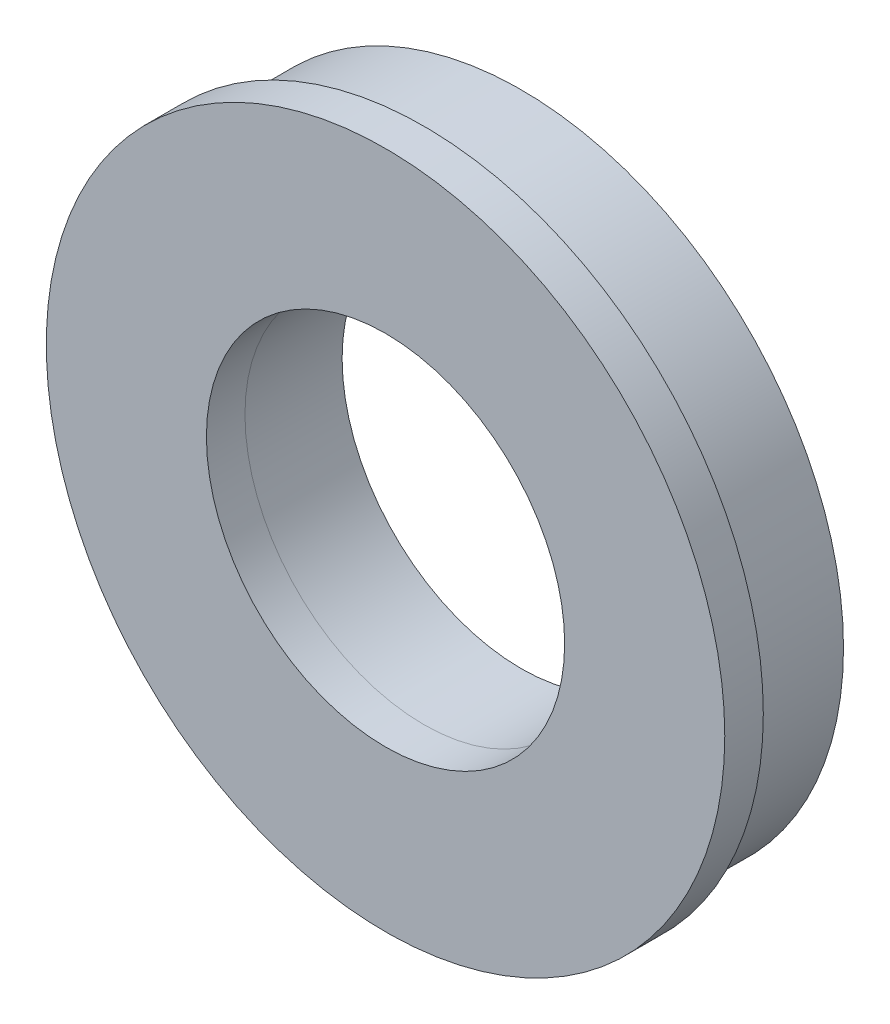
from build123d import *

# Parameters (mm, degrees)
SKETCH1_R      = 7.9375
SKETCH1_R_2    = 4.191
EXTRUDE1_DEPTH = 0.9017
SKETCH2_R      = 7.540625
SKETCH2_R_2    = 4.191
EXTRUDE2_DEPTH = 2.2733


with BuildPart() as part:
    # Sketch1 → Extrude1 (new body)
    with BuildSketch(Plane.XY):
        Circle(SKETCH1_R)
        Circle(SKETCH1_R_2, mode=Mode.SUBTRACT)
    extrude(amount=-EXTRUDE1_DEPTH)


with BuildPart() as body_2:
    # Sketch2 → Extrude2 (new body)
    with BuildSketch(Plane(origin=(0, 0, -0.9017), x_dir=(-1, 0, 0), z_dir=(0, 0, -1))):
        with Locations(Location((0, 0, 0), (0, 0, 180))):
            Circle(SKETCH2_R)
        with Locations(Location((0, 0, 0), (0, 0, 180))):
            Circle(SKETCH2_R_2, mode=Mode.SUBTRACT)
    extrude(amount=EXTRUDE2_DEPTH)


solid = Compound([part.part, body_2.part])
